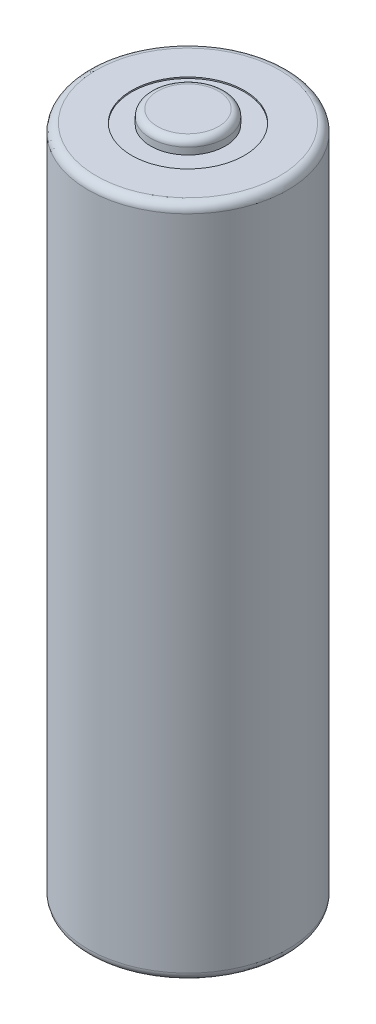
from build123d import *

# Parameters (mm, degrees)
FILLET1_R = 0.5


with BuildPart() as part:
    # Sketch1 → Revolve1 (revolve)
    with BuildSketch(Plane.XY, mode=Mode.PRIVATE) as revolve1_sk:
        Polygon((0, 50.5), (2.75, 50.5), (2.75, 49.5), (7.25, 49.5), (7.25, 0.1), (3.5, 0.1), (2.5, 0), (0, 0), align=None)
    revolve(revolve1_sk.sketch.rotate(Axis((0, 0, 0), (0, 1, 0)), 90), axis=Axis((0, 0, 0), (0, 1, 0)))

    # Fillet1
    fillet1_edges = [part.edges().sort_by_distance(p)[0] for p in [
        (0, 0.1, 7.25),
        (0, 49.5, 7.25),
        (0, 50.5, 2.75),
    ]]
    fillet(fillet1_edges, radius=FILLET1_R)

    # Sketch2 → Wrapper (revolve)
    with BuildSketch(Plane.XY, mode=Mode.PRIVATE) as wrapper_sk:
        with BuildLine():
            Line((6.75, 49.6), (4.15, 49.6))
            Line((4.15, 49.6), (4.15, 0))
            Line((4.15, 0), (6.75, 0))
            ThreePointArc((6.75, 0), (7.174264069, 0.175735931), (7.35, 0.6))
            Line((7.35, 0.6), (7.35, 49))
            ThreePointArc((7.35, 49), (7.174264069, 49.424264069), (6.75, 49.6))
        make_face()
        with BuildLine():
            Line((6.75, 49.5), (4.25, 49.5))
            Line((4.25, 49.5), (4.25, 0.1))
            Line((4.25, 0.1), (6.75, 0.1))
            ThreePointArc((6.75, 0.1), (7.103553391, 0.246446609), (7.25, 0.6))
            Line((7.25, 0.6), (7.25, 49))
            ThreePointArc((7.25, 49), (7.103553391, 49.353553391), (6.75, 49.5))
        make_face(mode=Mode.SUBTRACT)
    revolve(wrapper_sk.sketch.rotate(Axis((0, 0, 0), (0, 1, 0)), 90), axis=Axis((0, 0, 0), (0, 1, 0)))


solid = part.part
